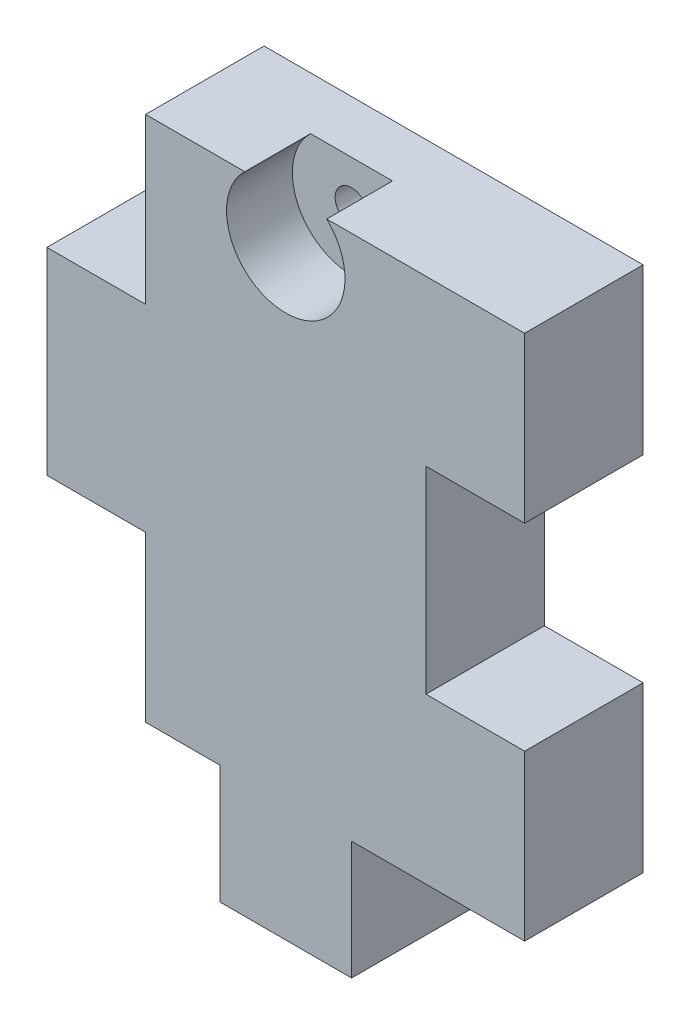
from build123d import *

# Parameters (mm, degrees)
BOSS_EXTRUDE1_DEPTH     = 18
SKETCH2_R               = 9
CUT_EXTRUDE1_DEPTH      = 10
SKETCH3_W               = 20
SKETCH3_H               = 23
BOSS_EXTRUDE2_DEPTH     = 18
CUT_EXTRUDE2_DEPTH      = 71.750901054
CUT_EXTRUDE2_DEPTH_BACK = 71.750901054
SKETCH6_R               = 2.5


with BuildPart() as part:
    # Sketch1 → Boss-Extrude1 (new body)
    with BuildSketch(Plane.XY):
        Polygon((-21.3, -40), (21.3, -40), (36.3, -40), (36.3, -15), (21.3, -15), (21.3, 15), (36.3, 15), (36.3, 40), (21.3, 40), (-21.3, 40), (-21.3, 15), (-36.3, 15), (-36.3, -15), (-21.3, -15), align=None)
    extrude(amount=BOSS_EXTRUDE1_DEPTH)

    # Sketch2 → Cut-Extrude1 (cut)
    with BuildSketch(Plane.XY.offset(18)):
        with Locations((0, 33.5)):
            Circle(SKETCH2_R)
    extrude(amount=-CUT_EXTRUDE1_DEPTH, mode=Mode.SUBTRACT)

    # Sketch3 → Boss-Extrude2 (add)
    with BuildSketch(Plane.XY.offset(18)):
        with Locations((0, -46.5)):
            Rectangle(SKETCH3_W, SKETCH3_H)
    extrude(amount=-BOSS_EXTRUDE2_DEPTH)

    # Sketch6 → Cut-Extrude2 (cut, two sides: drawn at the far end of the back side and taken through both)
    with BuildSketch(Plane.XY.offset(18).offset(-CUT_EXTRUDE2_DEPTH_BACK)):
        with Locations((0, 33.5)):
            Circle(SKETCH6_R)
    extrude(amount=CUT_EXTRUDE2_DEPTH + CUT_EXTRUDE2_DEPTH_BACK, mode=Mode.SUBTRACT)


solid = part.part
